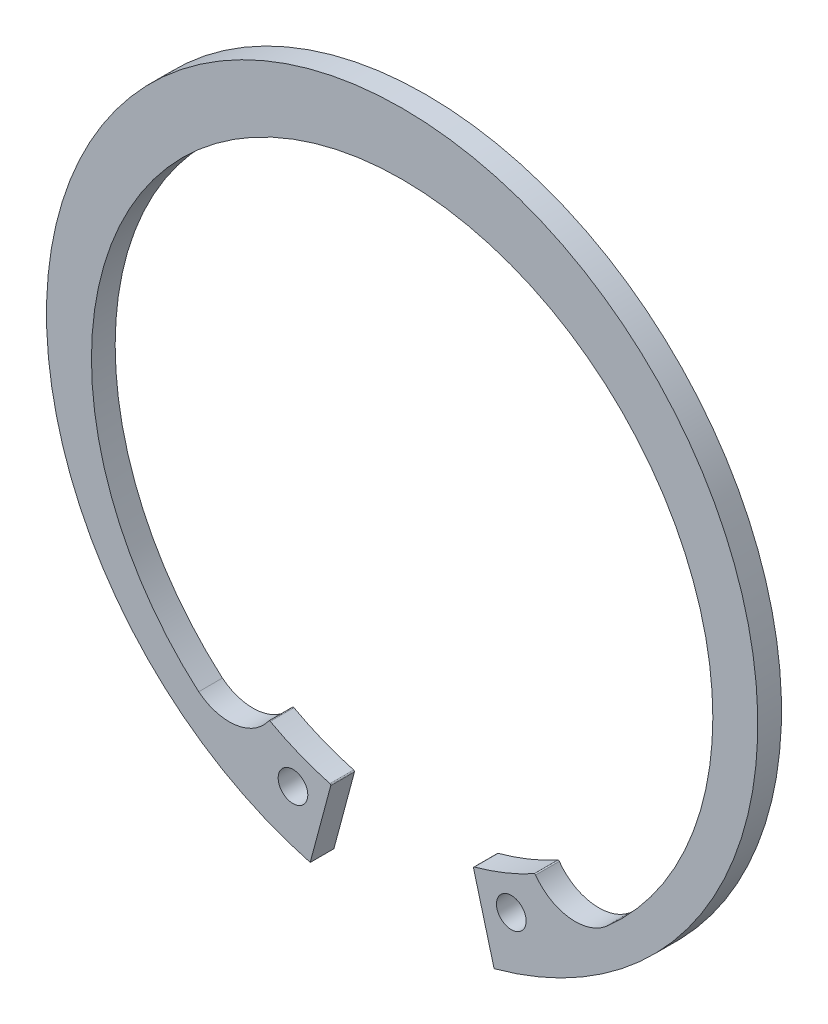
ISO-10303-21;
HEADER;
FILE_DESCRIPTION(('STEP AP214'),'2;1');
FILE_NAME('part.step','',(''),(''),'','','');
FILE_SCHEMA(('AUTOMOTIVE_DESIGN { 1 0 10303 214 1 1 1 1 }'));
ENDSEC;
DATA;
#1=APPLICATION_CONTEXT('core data for automotive mechanical design processes');
#2=APPLICATION_PROTOCOL_DEFINITION('international standard','automotive_design',2000,#1);
#3=PRODUCT_CONTEXT('',#1,'mechanical');
#4=PRODUCT('Part','Part','',(#3));
#5=PRODUCT_RELATED_PRODUCT_CATEGORY('part','',(#4));
#6=PRODUCT_DEFINITION_FORMATION('','',#4);
#7=PRODUCT_DEFINITION_CONTEXT('part definition',#1,'design');
#8=PRODUCT_DEFINITION('design','',#6,#7);
#9=PRODUCT_DEFINITION_SHAPE('','',#8);
#10=(LENGTH_UNIT() NAMED_UNIT(*) SI_UNIT(.MILLI.,.METRE.));
#11=(NAMED_UNIT(*) PLANE_ANGLE_UNIT() SI_UNIT($,.RADIAN.));
#12=(NAMED_UNIT(*) SI_UNIT($,.STERADIAN.) SOLID_ANGLE_UNIT());
#13=UNCERTAINTY_MEASURE_WITH_UNIT(LENGTH_MEASURE(1.E-05),#10,'distance_accuracy_value','');
#14=(GEOMETRIC_REPRESENTATION_CONTEXT(3) GLOBAL_UNCERTAINTY_ASSIGNED_CONTEXT((#13)) GLOBAL_UNIT_ASSIGNED_CONTEXT((#10,
#11,#12)) REPRESENTATION_CONTEXT('',''));
#15=CARTESIAN_POINT('',(0.,0.,0.));
#16=DIRECTION('',(0.,0.,1.));
#17=DIRECTION('',(1.,0.,0.));
#18=AXIS2_PLACEMENT_3D('',#15,#16,#17);
#19=CARTESIAN_POINT('',(0.,0.,-2.));
#20=DIRECTION('',(0.,0.,1.));
#21=DIRECTION('',(1.,0.,0.));
#22=AXIS2_PLACEMENT_3D('',#19,#20,#21);
#23=CYLINDRICAL_SURFACE('',#22,30.);
#24=CARTESIAN_POINT('',(0.,0.,-2.));
#25=DIRECTION('',(0.,0.,1.));
#26=DIRECTION('',(1.,0.,0.));
#27=AXIS2_PLACEMENT_3D('',#24,#25,#26);
#28=CIRCLE('',#27,30.);
#29=CARTESIAN_POINT('',(7.75698472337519,-28.9798065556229,-2.));
#30=VERTEX_POINT('',#29);
#31=CARTESIAN_POINT('',(-7.75698472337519,-28.9798065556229,-2.));
#32=VERTEX_POINT('',#31);
#33=EDGE_CURVE('E129',#30,#32,#28,.T.);
#34=ORIENTED_EDGE('',*,*,#33,.T.);
#35=DIRECTION('',(0.,0.,1.));
#36=VECTOR('',#35,1.);
#37=CARTESIAN_POINT('',(-7.75698472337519,-28.9798065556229,-2.));
#38=LINE('',#37,#36);
#39=CARTESIAN_POINT('',(-7.75698472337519,-28.9798065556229,0.));
#40=VERTEX_POINT('',#39);
#41=EDGE_CURVE('E19',#32,#40,#38,.T.);
#42=ORIENTED_EDGE('',*,*,#41,.T.);
#43=CARTESIAN_POINT('',(0.,0.,0.));
#44=DIRECTION('',(0.,0.,1.));
#45=DIRECTION('',(1.,0.,0.));
#46=AXIS2_PLACEMENT_3D('',#43,#44,#45);
#47=CIRCLE('',#46,30.);
#48=CARTESIAN_POINT('',(7.75698472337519,-28.9798065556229,0.));
#49=VERTEX_POINT('',#48);
#50=EDGE_CURVE('E40',#49,#40,#47,.T.);
#51=ORIENTED_EDGE('',*,*,#50,.F.);
#52=DIRECTION('',(0.,0.,1.));
#53=VECTOR('',#52,1.);
#54=CARTESIAN_POINT('',(7.75698472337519,-28.9798065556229,-2.));
#55=LINE('',#54,#53);
#56=EDGE_CURVE('E11',#30,#49,#55,.T.);
#57=ORIENTED_EDGE('',*,*,#56,.F.);
#58=EDGE_LOOP('',(#34,#42,#51,#57));
#59=FACE_BOUND('',#58,.T.);
#60=ADVANCED_FACE('F16',(#59),#23,.T.);
#61=CARTESIAN_POINT('',(7.75698472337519,-28.9798065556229,-2.));
#62=DIRECTION('',(-0.965993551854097,-0.258566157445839,0.));
#63=DIRECTION('',(0.258566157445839,-0.965993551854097,0.));
#64=AXIS2_PLACEMENT_3D('',#61,#62,#63);
#65=PLANE('',#64);
#66=DIRECTION('',(0.258566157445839,-0.965993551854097,0.));
#67=VECTOR('',#66,1.);
#68=CARTESIAN_POINT('',(7.75698472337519,-28.9798065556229,0.));
#69=LINE('',#68,#67);
#70=CARTESIAN_POINT('',(6.02453598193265,-22.5074424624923,0.));
#71=VERTEX_POINT('',#70);
#72=EDGE_CURVE('E232',#71,#49,#69,.T.);
#73=ORIENTED_EDGE('',*,*,#72,.F.);
#74=DIRECTION('',(0.,0.,1.));
#75=VECTOR('',#74,1.);
#76=CARTESIAN_POINT('',(6.02453598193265,-22.5074424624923,-2.));
#77=LINE('',#76,#75);
#78=CARTESIAN_POINT('',(6.02453598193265,-22.5074424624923,-2.));
#79=VERTEX_POINT('',#78);
#80=EDGE_CURVE('E205',#79,#71,#77,.T.);
#81=ORIENTED_EDGE('',*,*,#80,.F.);
#82=DIRECTION('',(0.258566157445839,-0.965993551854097,0.));
#83=VECTOR('',#82,1.);
#84=CARTESIAN_POINT('',(7.75698472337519,-28.9798065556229,-2.));
#85=LINE('',#84,#83);
#86=EDGE_CURVE('E235',#79,#30,#85,.T.);
#87=ORIENTED_EDGE('',*,*,#86,.T.);
#88=ORIENTED_EDGE('',*,*,#56,.T.);
#89=EDGE_LOOP('',(#73,#81,#87,#88));
#90=FACE_BOUND('',#89,.T.);
#91=ADVANCED_FACE('F248',(#90),#65,.T.);
#92=CARTESIAN_POINT('',(0.,-1.40683144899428,-2.));
#93=DIRECTION('',(0.,0.,1.));
#94=DIRECTION('',(1.,0.,0.));
#95=AXIS2_PLACEMENT_3D('',#92,#93,#94);
#96=CYLINDRICAL_SURFACE('',#95,26.2068314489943);
#97=DIRECTION('',(0.,0.,1.));
#98=VECTOR('',#97,1.);
#99=CARTESIAN_POINT('',(-17.1619312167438,-21.2125410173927,-2.));
#100=LINE('',#99,#98);
#101=CARTESIAN_POINT('',(-17.1619312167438,-21.2125410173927,-2.));
#102=VERTEX_POINT('',#101);
#103=CARTESIAN_POINT('',(-17.1619312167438,-21.2125410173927,0.));
#104=VERTEX_POINT('',#103);
#105=EDGE_CURVE('E170',#102,#104,#100,.T.);
#106=ORIENTED_EDGE('',*,*,#105,.F.);
#107=CARTESIAN_POINT('',(0.,-1.40683144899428,-2.));
#108=DIRECTION('',(0.,0.,-1.));
#109=DIRECTION('',(1.,0.,0.));
#110=AXIS2_PLACEMENT_3D('',#107,#108,#109);
#111=CIRCLE('',#110,26.2068314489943);
#112=CARTESIAN_POINT('',(17.1619312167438,-21.2125410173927,-2.));
#113=VERTEX_POINT('',#112);
#114=EDGE_CURVE('E48',#102,#113,#111,.T.);
#115=ORIENTED_EDGE('',*,*,#114,.T.);
#116=DIRECTION('',(0.,0.,1.));
#117=VECTOR('',#116,1.);
#118=CARTESIAN_POINT('',(17.1619312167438,-21.2125410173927,-2.));
#119=LINE('',#118,#117);
#120=CARTESIAN_POINT('',(17.1619312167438,-21.2125410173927,0.));
#121=VERTEX_POINT('',#120);
#122=EDGE_CURVE('E208',#121,#113,#119,.F.);
#123=ORIENTED_EDGE('',*,*,#122,.F.);
#124=CARTESIAN_POINT('',(0.,-1.40683144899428,0.));
#125=DIRECTION('',(0.,0.,-1.));
#126=DIRECTION('',(1.,0.,0.));
#127=AXIS2_PLACEMENT_3D('',#124,#125,#126);
#128=CIRCLE('',#127,26.2068314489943);
#129=EDGE_CURVE('E241',#104,#121,#128,.T.);
#130=ORIENTED_EDGE('',*,*,#129,.F.);
#131=EDGE_LOOP('',(#106,#115,#123,#130));
#132=FACE_BOUND('',#131,.T.);
#133=ADVANCED_FACE('F270',(#132),#96,.F.);
#134=CARTESIAN_POINT('',(-7.75698472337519,-28.9798065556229,-2.));
#135=DIRECTION('',(0.965993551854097,-0.258566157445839,0.));
#136=DIRECTION('',(0.258566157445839,0.965993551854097,0.));
#137=AXIS2_PLACEMENT_3D('',#134,#135,#136);
#138=PLANE('',#137);
#139=DIRECTION('',(0.258566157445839,0.965993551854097,0.));
#140=VECTOR('',#139,1.);
#141=CARTESIAN_POINT('',(-7.75698472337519,-28.9798065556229,0.));
#142=LINE('',#141,#140);
#143=CARTESIAN_POINT('',(-6.02453598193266,-22.5074424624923,0.));
#144=VERTEX_POINT('',#143);
#145=EDGE_CURVE('E239',#40,#144,#142,.T.);
#146=ORIENTED_EDGE('',*,*,#145,.F.);
#147=ORIENTED_EDGE('',*,*,#41,.F.);
#148=DIRECTION('',(0.258566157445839,0.965993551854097,0.));
#149=VECTOR('',#148,1.);
#150=CARTESIAN_POINT('',(-7.75698472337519,-28.9798065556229,-2.));
#151=LINE('',#150,#149);
#152=CARTESIAN_POINT('',(-6.02453598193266,-22.5074424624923,-2.));
#153=VERTEX_POINT('',#152);
#154=EDGE_CURVE('E121',#32,#153,#151,.T.);
#155=ORIENTED_EDGE('',*,*,#154,.T.);
#156=DIRECTION('',(0.,0.,1.));
#157=VECTOR('',#156,1.);
#158=CARTESIAN_POINT('',(-6.02453598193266,-22.5074424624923,-2.));
#159=LINE('',#158,#157);
#160=EDGE_CURVE('E125',#153,#144,#159,.T.);
#161=ORIENTED_EDGE('',*,*,#160,.T.);
#162=EDGE_LOOP('',(#146,#147,#155,#161));
#163=FACE_BOUND('',#162,.T.);
#164=ADVANCED_FACE('F124',(#163),#138,.T.);
#165=CARTESIAN_POINT('',(0.,0.,-2.));
#166=DIRECTION('',(0.,0.,1.));
#167=DIRECTION('',(1.,0.,0.));
#168=AXIS2_PLACEMENT_3D('',#165,#166,#167);
#169=PLANE('',#168);
#170=ORIENTED_EDGE('',*,*,#114,.F.);
#171=DIRECTION('',(-0.628974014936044,-0.777426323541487,0.));
#172=VECTOR('',#171,1.);
#173=CARTESIAN_POINT('',(-18.8692204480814,-23.3227897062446,-2.));
#174=LINE('',#173,#172);
#175=CARTESIAN_POINT('',(-17.160195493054,-21.2103956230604,-2.));
#176=VERTEX_POINT('',#175);
#177=EDGE_CURVE('E139',#176,#102,#174,.T.);
#178=ORIENTED_EDGE('',*,*,#177,.F.);
#179=CARTESIAN_POINT('',(-14.5921971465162,-18.0362907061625,-2.));
#180=DIRECTION('',(0.,0.,-1.));
#181=DIRECTION('',(1.,0.,0.));
#182=AXIS2_PLACEMENT_3D('',#179,#180,#181);
#183=CIRCLE('',#182,4.08283694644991);
#184=CARTESIAN_POINT('',(-11.2550804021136,-20.3885681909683,-2.));
#185=VERTEX_POINT('',#184);
#186=EDGE_CURVE('E156',#185,#176,#183,.T.);
#187=ORIENTED_EDGE('',*,*,#186,.F.);
#188=CARTESIAN_POINT('',(-11.1733451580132,-20.4461819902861,-2.));
#189=DIRECTION('',(0.,0.,1.));
#190=DIRECTION('',(1.,0.,0.));
#191=AXIS2_PLACEMENT_3D('',#188,#189,#190);
#192=CIRCLE('',#191,0.0999999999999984);
#193=CARTESIAN_POINT('',(-11.1253908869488,-20.3584301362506,-2.));
#194=VERTEX_POINT('',#193);
#195=EDGE_CURVE('E148',#194,#185,#192,.T.);
#196=ORIENTED_EDGE('',*,*,#195,.F.);
#197=CARTESIAN_POINT('',(0.,0.,-2.));
#198=DIRECTION('',(0.,0.,-1.));
#199=DIRECTION('',(1.,0.,0.));
#200=AXIS2_PLACEMENT_3D('',#197,#198,#199);
#201=CIRCLE('',#200,23.2);
#202=CARTESIAN_POINT('',(-6.09486437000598,-22.3850983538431,-2.));
#203=VERTEX_POINT('',#202);
#204=EDGE_CURVE('E144',#203,#194,#201,.T.);
#205=ORIENTED_EDGE('',*,*,#204,.F.);
#206=CARTESIAN_POINT('',(-6.12113533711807,-22.4815858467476,-2.));
#207=DIRECTION('',(0.,0.,1.));
#208=DIRECTION('',(-1.,0.,0.));
#209=AXIS2_PLACEMENT_3D('',#206,#207,#208);
#210=CIRCLE('',#209,0.1);
#211=EDGE_CURVE('E135',#153,#203,#210,.T.);
#212=ORIENTED_EDGE('',*,*,#211,.F.);
#213=ORIENTED_EDGE('',*,*,#154,.F.);
#214=ORIENTED_EDGE('',*,*,#33,.F.);
#215=ORIENTED_EDGE('',*,*,#86,.F.);
#216=CARTESIAN_POINT('',(6.12113533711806,-22.4815858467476,-2.));
#217=DIRECTION('',(0.,0.,1.));
#218=DIRECTION('',(1.,0.,0.));
#219=AXIS2_PLACEMENT_3D('',#216,#217,#218);
#220=CIRCLE('',#219,0.100000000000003);
#221=CARTESIAN_POINT('',(6.09486437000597,-22.3850983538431,-2.));
#222=VERTEX_POINT('',#221);
#223=EDGE_CURVE('E190',#222,#79,#220,.T.);
#224=ORIENTED_EDGE('',*,*,#223,.F.);
#225=CARTESIAN_POINT('',(0.,0.,-2.));
#226=DIRECTION('',(0.,0.,-1.));
#227=DIRECTION('',(1.,0.,0.));
#228=AXIS2_PLACEMENT_3D('',#225,#226,#227);
#229=CIRCLE('',#228,23.2);
#230=CARTESIAN_POINT('',(11.1253908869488,-20.3584301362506,-2.));
#231=VERTEX_POINT('',#230);
#232=EDGE_CURVE('E188',#231,#222,#229,.T.);
#233=ORIENTED_EDGE('',*,*,#232,.F.);
#234=CARTESIAN_POINT('',(11.1733451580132,-20.4461819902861,-2.));
#235=DIRECTION('',(0.,0.,1.));
#236=DIRECTION('',(-1.,0.,0.));
#237=AXIS2_PLACEMENT_3D('',#234,#235,#236);
#238=CIRCLE('',#237,0.0999999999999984);
#239=CARTESIAN_POINT('',(11.2550804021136,-20.3885681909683,-2.));
#240=VERTEX_POINT('',#239);
#241=EDGE_CURVE('E185',#240,#231,#238,.T.);
#242=ORIENTED_EDGE('',*,*,#241,.F.);
#243=CARTESIAN_POINT('',(14.5921971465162,-18.0362907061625,-2.));
#244=DIRECTION('',(0.,0.,-1.));
#245=DIRECTION('',(1.,0.,0.));
#246=AXIS2_PLACEMENT_3D('',#243,#244,#245);
#247=CIRCLE('',#246,4.08283694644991);
#248=CARTESIAN_POINT('',(17.160195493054,-21.2103956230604,-2.));
#249=VERTEX_POINT('',#248);
#250=EDGE_CURVE('E181',#249,#240,#247,.T.);
#251=ORIENTED_EDGE('',*,*,#250,.F.);
#252=DIRECTION('',(-0.628974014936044,0.777426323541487,0.));
#253=VECTOR('',#252,1.);
#254=CARTESIAN_POINT('',(17.160195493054,-21.2103956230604,-2.));
#255=LINE('',#254,#253);
#256=EDGE_CURVE('E179',#113,#249,#255,.T.);
#257=ORIENTED_EDGE('',*,*,#256,.F.);
#258=EDGE_LOOP('',(#170,#178,#187,#196,#205,#212,#213,#214,#215,#224,#233,#242,#251,#257));
#259=FACE_BOUND('',#258,.T.);
#260=CARTESIAN_POINT('',(9.20860383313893,-24.1541738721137,-2.));
#261=DIRECTION('',(0.,0.,1.));
#262=DIRECTION('',(1.,0.,0.));
#263=AXIS2_PLACEMENT_3D('',#260,#261,#262);
#264=CIRCLE('',#263,1.25);
#265=CARTESIAN_POINT('',(10.4586038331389,-24.1541738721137,-2.));
#266=VERTEX_POINT('',#265);
#267=EDGE_CURVE('E227',#266,#266,#264,.T.);
#268=ORIENTED_EDGE('',*,*,#267,.T.);
#269=EDGE_LOOP('',(#268));
#270=FACE_BOUND('',#269,.T.);
#271=CARTESIAN_POINT('',(-9.20860383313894,-24.1541738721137,-2.));
#272=DIRECTION('',(0.,0.,1.));
#273=DIRECTION('',(1.,0.,0.));
#274=AXIS2_PLACEMENT_3D('',#271,#272,#273);
#275=CIRCLE('',#274,1.25);
#276=CARTESIAN_POINT('',(-7.95860383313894,-24.1541738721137,-2.));
#277=VERTEX_POINT('',#276);
#278=EDGE_CURVE('E221',#277,#277,#275,.T.);
#279=ORIENTED_EDGE('',*,*,#278,.T.);
#280=EDGE_LOOP('',(#279));
#281=FACE_BOUND('',#280,.T.);
#282=ADVANCED_FACE('F141',(#259,#270,#281),#169,.F.);
#283=CARTESIAN_POINT('',(0.,0.,0.));
#284=DIRECTION('',(0.,0.,1.));
#285=DIRECTION('',(1.,0.,0.));
#286=AXIS2_PLACEMENT_3D('',#283,#284,#285);
#287=PLANE('',#286);
#288=DIRECTION('',(-0.628974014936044,-0.777426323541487,0.));
#289=VECTOR('',#288,1.);
#290=CARTESIAN_POINT('',(-18.8692204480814,-23.3227897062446,0.));
#291=LINE('',#290,#289);
#292=CARTESIAN_POINT('',(-17.160195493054,-21.2103956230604,0.));
#293=VERTEX_POINT('',#292);
#294=EDGE_CURVE('E146',#293,#104,#291,.T.);
#295=ORIENTED_EDGE('',*,*,#294,.T.);
#296=ORIENTED_EDGE('',*,*,#129,.T.);
#297=DIRECTION('',(-0.628974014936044,0.777426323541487,0.));
#298=VECTOR('',#297,1.);
#299=CARTESIAN_POINT('',(17.160195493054,-21.2103956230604,0.));
#300=LINE('',#299,#298);
#301=CARTESIAN_POINT('',(17.160195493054,-21.2103956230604,0.));
#302=VERTEX_POINT('',#301);
#303=EDGE_CURVE('E178',#121,#302,#300,.T.);
#304=ORIENTED_EDGE('',*,*,#303,.T.);
#305=CARTESIAN_POINT('',(14.5921971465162,-18.0362907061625,0.));
#306=DIRECTION('',(0.,0.,-1.));
#307=DIRECTION('',(1.,0.,0.));
#308=AXIS2_PLACEMENT_3D('',#305,#306,#307);
#309=CIRCLE('',#308,4.08283694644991);
#310=CARTESIAN_POINT('',(11.2550804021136,-20.3885681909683,0.));
#311=VERTEX_POINT('',#310);
#312=EDGE_CURVE('E195',#302,#311,#309,.T.);
#313=ORIENTED_EDGE('',*,*,#312,.T.);
#314=CARTESIAN_POINT('',(11.1733451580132,-20.4461819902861,0.));
#315=DIRECTION('',(0.,0.,1.));
#316=DIRECTION('',(-1.,0.,0.));
#317=AXIS2_PLACEMENT_3D('',#314,#315,#316);
#318=CIRCLE('',#317,0.0999999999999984);
#319=CARTESIAN_POINT('',(11.1253908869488,-20.3584301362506,0.));
#320=VERTEX_POINT('',#319);
#321=EDGE_CURVE('E198',#311,#320,#318,.T.);
#322=ORIENTED_EDGE('',*,*,#321,.T.);
#323=CARTESIAN_POINT('',(0.,0.,0.));
#324=DIRECTION('',(0.,0.,-1.));
#325=DIRECTION('',(1.,0.,0.));
#326=AXIS2_PLACEMENT_3D('',#323,#324,#325);
#327=CIRCLE('',#326,23.2);
#328=CARTESIAN_POINT('',(6.09486437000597,-22.3850983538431,0.));
#329=VERTEX_POINT('',#328);
#330=EDGE_CURVE('E201',#320,#329,#327,.T.);
#331=ORIENTED_EDGE('',*,*,#330,.T.);
#332=CARTESIAN_POINT('',(6.12113533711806,-22.4815858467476,0.));
#333=DIRECTION('',(0.,0.,1.));
#334=DIRECTION('',(1.,0.,0.));
#335=AXIS2_PLACEMENT_3D('',#332,#333,#334);
#336=CIRCLE('',#335,0.100000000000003);
#337=EDGE_CURVE('E182',#329,#71,#336,.T.);
#338=ORIENTED_EDGE('',*,*,#337,.T.);
#339=ORIENTED_EDGE('',*,*,#72,.T.);
#340=ORIENTED_EDGE('',*,*,#50,.T.);
#341=ORIENTED_EDGE('',*,*,#145,.T.);
#342=CARTESIAN_POINT('',(-6.12113533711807,-22.4815858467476,0.));
#343=DIRECTION('',(0.,0.,1.));
#344=DIRECTION('',(-1.,0.,0.));
#345=AXIS2_PLACEMENT_3D('',#342,#343,#344);
#346=CIRCLE('',#345,0.1);
#347=CARTESIAN_POINT('',(-6.09486437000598,-22.3850983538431,0.));
#348=VERTEX_POINT('',#347);
#349=EDGE_CURVE('E137',#144,#348,#346,.T.);
#350=ORIENTED_EDGE('',*,*,#349,.T.);
#351=CARTESIAN_POINT('',(0.,0.,0.));
#352=DIRECTION('',(0.,0.,-1.));
#353=DIRECTION('',(1.,0.,0.));
#354=AXIS2_PLACEMENT_3D('',#351,#352,#353);
#355=CIRCLE('',#354,23.2);
#356=CARTESIAN_POINT('',(-11.1253908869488,-20.3584301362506,0.));
#357=VERTEX_POINT('',#356);
#358=EDGE_CURVE('E161',#348,#357,#355,.T.);
#359=ORIENTED_EDGE('',*,*,#358,.T.);
#360=CARTESIAN_POINT('',(-11.1733451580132,-20.4461819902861,0.));
#361=DIRECTION('',(0.,0.,1.));
#362=DIRECTION('',(1.,0.,0.));
#363=AXIS2_PLACEMENT_3D('',#360,#361,#362);
#364=CIRCLE('',#363,0.0999999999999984);
#365=CARTESIAN_POINT('',(-11.2550804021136,-20.3885681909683,0.));
#366=VERTEX_POINT('',#365);
#367=EDGE_CURVE('E163',#357,#366,#364,.T.);
#368=ORIENTED_EDGE('',*,*,#367,.T.);
#369=CARTESIAN_POINT('',(-14.5921971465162,-18.0362907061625,0.));
#370=DIRECTION('',(0.,0.,-1.));
#371=DIRECTION('',(1.,0.,0.));
#372=AXIS2_PLACEMENT_3D('',#369,#370,#371);
#373=CIRCLE('',#372,4.08283694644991);
#374=EDGE_CURVE('E151',#366,#293,#373,.T.);
#375=ORIENTED_EDGE('',*,*,#374,.T.);
#376=EDGE_LOOP('',(#295,#296,#304,#313,#322,#331,#338,#339,#340,#341,#350,#359,#368,#375));
#377=FACE_BOUND('',#376,.T.);
#378=CARTESIAN_POINT('',(9.20860383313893,-24.1541738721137,0.));
#379=DIRECTION('',(0.,0.,1.));
#380=DIRECTION('',(1.,0.,0.));
#381=AXIS2_PLACEMENT_3D('',#378,#379,#380);
#382=CIRCLE('',#381,1.25);
#383=CARTESIAN_POINT('',(10.4586038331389,-24.1541738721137,0.));
#384=VERTEX_POINT('',#383);
#385=EDGE_CURVE('E224',#384,#384,#382,.T.);
#386=ORIENTED_EDGE('',*,*,#385,.F.);
#387=EDGE_LOOP('',(#386));
#388=FACE_BOUND('',#387,.T.);
#389=CARTESIAN_POINT('',(-9.20860383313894,-24.1541738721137,0.));
#390=DIRECTION('',(0.,0.,1.));
#391=DIRECTION('',(1.,0.,0.));
#392=AXIS2_PLACEMENT_3D('',#389,#390,#391);
#393=CIRCLE('',#392,1.25);
#394=CARTESIAN_POINT('',(-7.95860383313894,-24.1541738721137,0.));
#395=VERTEX_POINT('',#394);
#396=EDGE_CURVE('E220',#395,#395,#393,.T.);
#397=ORIENTED_EDGE('',*,*,#396,.F.);
#398=EDGE_LOOP('',(#397));
#399=FACE_BOUND('',#398,.T.);
#400=ADVANCED_FACE('F243',(#377,#388,#399),#287,.T.);
#401=CARTESIAN_POINT('',(9.20860383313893,-24.1541738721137,-2.));
#402=DIRECTION('',(0.,0.,1.));
#403=DIRECTION('',(1.,0.,0.));
#404=AXIS2_PLACEMENT_3D('',#401,#402,#403);
#405=CYLINDRICAL_SURFACE('',#404,1.25);
#406=ORIENTED_EDGE('',*,*,#267,.F.);
#407=EDGE_LOOP('',(#406));
#408=FACE_BOUND('',#407,.T.);
#409=ORIENTED_EDGE('',*,*,#385,.T.);
#410=EDGE_LOOP('',(#409));
#411=FACE_BOUND('',#410,.T.);
#412=ADVANCED_FACE('F295',(#408,#411),#405,.F.);
#413=CARTESIAN_POINT('',(-9.20860383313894,-24.1541738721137,-2.));
#414=DIRECTION('',(0.,0.,1.));
#415=DIRECTION('',(1.,0.,0.));
#416=AXIS2_PLACEMENT_3D('',#413,#414,#415);
#417=CYLINDRICAL_SURFACE('',#416,1.25);
#418=ORIENTED_EDGE('',*,*,#278,.F.);
#419=EDGE_LOOP('',(#418));
#420=FACE_BOUND('',#419,.T.);
#421=ORIENTED_EDGE('',*,*,#396,.T.);
#422=EDGE_LOOP('',(#421));
#423=FACE_BOUND('',#422,.T.);
#424=ADVANCED_FACE('F286',(#420,#423),#417,.F.);
#425=CARTESIAN_POINT('',(0.,0.,-2.));
#426=DIRECTION('',(0.,0.,1.));
#427=DIRECTION('',(1.,0.,0.));
#428=AXIS2_PLACEMENT_3D('',#425,#426,#427);
#429=CYLINDRICAL_SURFACE('',#428,23.2);
#430=ORIENTED_EDGE('',*,*,#330,.F.);
#431=DIRECTION('',(0.,0.,1.));
#432=VECTOR('',#431,1.);
#433=CARTESIAN_POINT('',(11.1253908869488,-20.3584301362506,-2.));
#434=LINE('',#433,#432);
#435=EDGE_CURVE('E212',#231,#320,#434,.T.);
#436=ORIENTED_EDGE('',*,*,#435,.F.);
#437=ORIENTED_EDGE('',*,*,#232,.T.);
#438=DIRECTION('',(0.,0.,1.));
#439=VECTOR('',#438,1.);
#440=CARTESIAN_POINT('',(6.09486437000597,-22.3850983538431,-2.));
#441=LINE('',#440,#439);
#442=EDGE_CURVE('E209',#222,#329,#441,.T.);
#443=ORIENTED_EDGE('',*,*,#442,.T.);
#444=EDGE_LOOP('',(#430,#436,#437,#443));
#445=FACE_BOUND('',#444,.T.);
#446=ADVANCED_FACE('F284',(#445),#429,.F.);
#447=CARTESIAN_POINT('',(6.12113533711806,-22.4815858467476,-2.));
#448=DIRECTION('',(0.,0.,1.));
#449=DIRECTION('',(1.,0.,0.));
#450=AXIS2_PLACEMENT_3D('',#447,#448,#449);
#451=CYLINDRICAL_SURFACE('',#450,0.100000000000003);
#452=ORIENTED_EDGE('',*,*,#337,.F.);
#453=ORIENTED_EDGE('',*,*,#442,.F.);
#454=ORIENTED_EDGE('',*,*,#223,.T.);
#455=ORIENTED_EDGE('',*,*,#80,.T.);
#456=EDGE_LOOP('',(#452,#453,#454,#455));
#457=FACE_BOUND('',#456,.T.);
#458=ADVANCED_FACE('F250',(#457),#451,.T.);
#459=CARTESIAN_POINT('',(11.1733451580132,-20.4461819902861,-2.));
#460=DIRECTION('',(0.,0.,1.));
#461=DIRECTION('',(1.,0.,0.));
#462=AXIS2_PLACEMENT_3D('',#459,#460,#461);
#463=CYLINDRICAL_SURFACE('',#462,0.0999999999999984);
#464=ORIENTED_EDGE('',*,*,#321,.F.);
#465=DIRECTION('',(0.,0.,1.));
#466=VECTOR('',#465,1.);
#467=CARTESIAN_POINT('',(11.2550804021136,-20.3885681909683,-2.));
#468=LINE('',#467,#466);
#469=EDGE_CURVE('E215',#240,#311,#468,.T.);
#470=ORIENTED_EDGE('',*,*,#469,.F.);
#471=ORIENTED_EDGE('',*,*,#241,.T.);
#472=ORIENTED_EDGE('',*,*,#435,.T.);
#473=EDGE_LOOP('',(#464,#470,#471,#472));
#474=FACE_BOUND('',#473,.T.);
#475=ADVANCED_FACE('F282',(#474),#463,.T.);
#476=CARTESIAN_POINT('',(14.5921971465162,-18.0362907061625,-2.));
#477=DIRECTION('',(0.,0.,1.));
#478=DIRECTION('',(1.,0.,0.));
#479=AXIS2_PLACEMENT_3D('',#476,#477,#478);
#480=CYLINDRICAL_SURFACE('',#479,4.08283694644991);
#481=ORIENTED_EDGE('',*,*,#312,.F.);
#482=DIRECTION('',(0.,0.,1.));
#483=VECTOR('',#482,1.);
#484=CARTESIAN_POINT('',(17.160195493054,-21.2103956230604,-2.));
#485=LINE('',#484,#483);
#486=EDGE_CURVE('E193',#249,#302,#485,.T.);
#487=ORIENTED_EDGE('',*,*,#486,.F.);
#488=ORIENTED_EDGE('',*,*,#250,.T.);
#489=ORIENTED_EDGE('',*,*,#469,.T.);
#490=EDGE_LOOP('',(#481,#487,#488,#489));
#491=FACE_BOUND('',#490,.T.);
#492=ADVANCED_FACE('F279',(#491),#480,.F.);
#493=CARTESIAN_POINT('',(17.160195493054,-21.2103956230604,-2.));
#494=DIRECTION('',(0.777426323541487,0.628974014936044,0.));
#495=DIRECTION('',(-0.628974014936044,0.777426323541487,0.));
#496=AXIS2_PLACEMENT_3D('',#493,#494,#495);
#497=PLANE('',#496);
#498=ORIENTED_EDGE('',*,*,#303,.F.);
#499=ORIENTED_EDGE('',*,*,#122,.T.);
#500=ORIENTED_EDGE('',*,*,#256,.T.);
#501=ORIENTED_EDGE('',*,*,#486,.T.);
#502=EDGE_LOOP('',(#498,#499,#500,#501));
#503=FACE_BOUND('',#502,.T.);
#504=ADVANCED_FACE('F276',(#503),#497,.T.);
#505=CARTESIAN_POINT('',(0.,0.,-2.));
#506=DIRECTION('',(0.,0.,1.));
#507=DIRECTION('',(1.,0.,0.));
#508=AXIS2_PLACEMENT_3D('',#505,#506,#507);
#509=CYLINDRICAL_SURFACE('',#508,23.2);
#510=ORIENTED_EDGE('',*,*,#358,.F.);
#511=DIRECTION('',(0.,0.,1.));
#512=VECTOR('',#511,1.);
#513=CARTESIAN_POINT('',(-6.09486437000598,-22.3850983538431,-2.));
#514=LINE('',#513,#512);
#515=EDGE_CURVE('E138',#203,#348,#514,.T.);
#516=ORIENTED_EDGE('',*,*,#515,.F.);
#517=ORIENTED_EDGE('',*,*,#204,.T.);
#518=DIRECTION('',(0.,0.,1.));
#519=VECTOR('',#518,1.);
#520=CARTESIAN_POINT('',(-11.1253908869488,-20.3584301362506,-2.));
#521=LINE('',#520,#519);
#522=EDGE_CURVE('E173',#194,#357,#521,.T.);
#523=ORIENTED_EDGE('',*,*,#522,.T.);
#524=EDGE_LOOP('',(#510,#516,#517,#523));
#525=FACE_BOUND('',#524,.T.);
#526=ADVANCED_FACE('F258',(#525),#509,.F.);
#527=CARTESIAN_POINT('',(-18.8692204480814,-23.3227897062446,-2.));
#528=DIRECTION('',(-0.777426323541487,0.628974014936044,0.));
#529=DIRECTION('',(-0.628974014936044,-0.777426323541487,0.));
#530=AXIS2_PLACEMENT_3D('',#527,#528,#529);
#531=PLANE('',#530);
#532=ORIENTED_EDGE('',*,*,#177,.T.);
#533=ORIENTED_EDGE('',*,*,#105,.T.);
#534=ORIENTED_EDGE('',*,*,#294,.F.);
#535=DIRECTION('',(0.,0.,1.));
#536=VECTOR('',#535,1.);
#537=CARTESIAN_POINT('',(-17.160195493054,-21.2103956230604,-2.));
#538=LINE('',#537,#536);
#539=EDGE_CURVE('E168',#176,#293,#538,.T.);
#540=ORIENTED_EDGE('',*,*,#539,.F.);
#541=EDGE_LOOP('',(#532,#533,#534,#540));
#542=FACE_BOUND('',#541,.T.);
#543=ADVANCED_FACE('F268',(#542),#531,.T.);
#544=CARTESIAN_POINT('',(-14.5921971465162,-18.0362907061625,-2.));
#545=DIRECTION('',(0.,0.,1.));
#546=DIRECTION('',(1.,0.,0.));
#547=AXIS2_PLACEMENT_3D('',#544,#545,#546);
#548=CYLINDRICAL_SURFACE('',#547,4.08283694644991);
#549=ORIENTED_EDGE('',*,*,#374,.F.);
#550=DIRECTION('',(0.,0.,1.));
#551=VECTOR('',#550,1.);
#552=CARTESIAN_POINT('',(-11.2550804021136,-20.3885681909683,-2.));
#553=LINE('',#552,#551);
#554=EDGE_CURVE('E171',#185,#366,#553,.T.);
#555=ORIENTED_EDGE('',*,*,#554,.F.);
#556=ORIENTED_EDGE('',*,*,#186,.T.);
#557=ORIENTED_EDGE('',*,*,#539,.T.);
#558=EDGE_LOOP('',(#549,#555,#556,#557));
#559=FACE_BOUND('',#558,.T.);
#560=ADVANCED_FACE('F264',(#559),#548,.F.);
#561=CARTESIAN_POINT('',(-11.1733451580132,-20.4461819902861,-2.));
#562=DIRECTION('',(0.,0.,1.));
#563=DIRECTION('',(1.,0.,0.));
#564=AXIS2_PLACEMENT_3D('',#561,#562,#563);
#565=CYLINDRICAL_SURFACE('',#564,0.0999999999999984);
#566=ORIENTED_EDGE('',*,*,#367,.F.);
#567=ORIENTED_EDGE('',*,*,#522,.F.);
#568=ORIENTED_EDGE('',*,*,#195,.T.);
#569=ORIENTED_EDGE('',*,*,#554,.T.);
#570=EDGE_LOOP('',(#566,#567,#568,#569));
#571=FACE_BOUND('',#570,.T.);
#572=ADVANCED_FACE('F260',(#571),#565,.T.);
#573=CARTESIAN_POINT('',(-6.12113533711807,-22.4815858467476,-2.));
#574=DIRECTION('',(0.,0.,1.));
#575=DIRECTION('',(1.,0.,0.));
#576=AXIS2_PLACEMENT_3D('',#573,#574,#575);
#577=CYLINDRICAL_SURFACE('',#576,0.1);
#578=ORIENTED_EDGE('',*,*,#349,.F.);
#579=ORIENTED_EDGE('',*,*,#160,.F.);
#580=ORIENTED_EDGE('',*,*,#211,.T.);
#581=ORIENTED_EDGE('',*,*,#515,.T.);
#582=EDGE_LOOP('',(#578,#579,#580,#581));
#583=FACE_BOUND('',#582,.T.);
#584=ADVANCED_FACE('F133',(#583),#577,.T.);
#585=CLOSED_SHELL('',(#60,#91,#133,#164,#282,#400,#412,#424,#446,#458,#475,#492,#504,#526,#543,
#560,#572,#584));
#586=MANIFOLD_SOLID_BREP('B1',#585);
#587=ADVANCED_BREP_SHAPE_REPRESENTATION('',(#18,#586),#14);
#588=SHAPE_DEFINITION_REPRESENTATION(#9,#587);
ENDSEC;
END-ISO-10303-21;
